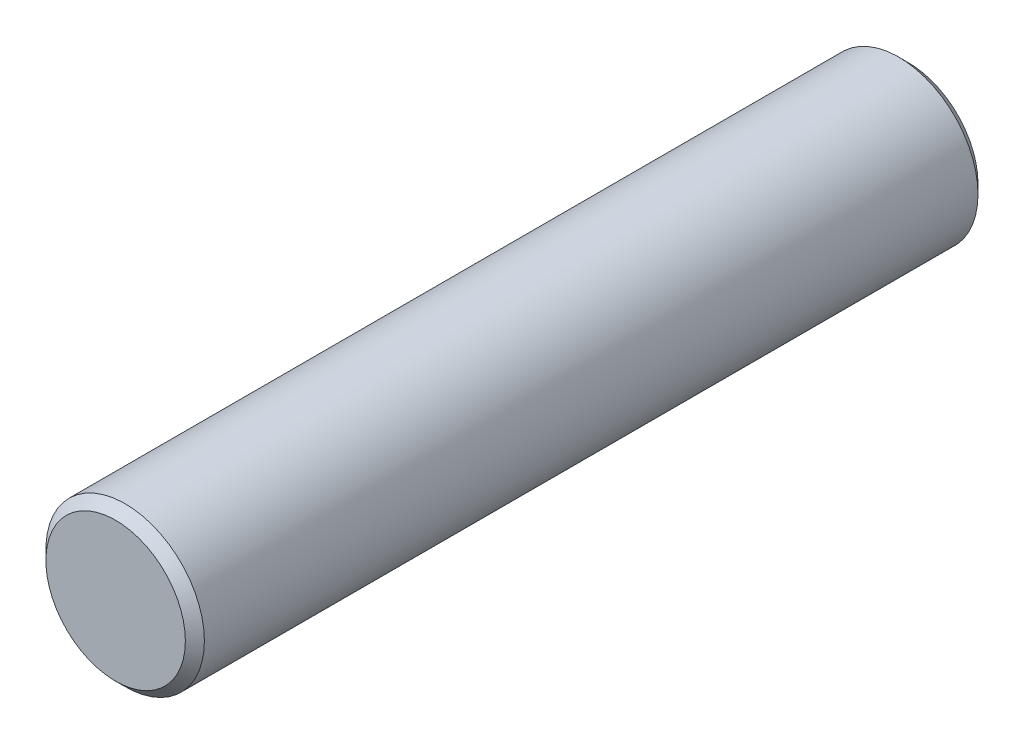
ISO-10303-21;
HEADER;
FILE_DESCRIPTION(('STEP AP214'),'2;1');
FILE_NAME('part.step','',(''),(''),'','','');
FILE_SCHEMA(('AUTOMOTIVE_DESIGN { 1 0 10303 214 1 1 1 1 }'));
ENDSEC;
DATA;
#1=APPLICATION_CONTEXT('core data for automotive mechanical design processes');
#2=APPLICATION_PROTOCOL_DEFINITION('international standard','automotive_design',2000,#1);
#3=PRODUCT_CONTEXT('',#1,'mechanical');
#4=PRODUCT('Part','Part','',(#3));
#5=PRODUCT_RELATED_PRODUCT_CATEGORY('part','',(#4));
#6=PRODUCT_DEFINITION_FORMATION('','',#4);
#7=PRODUCT_DEFINITION_CONTEXT('part definition',#1,'design');
#8=PRODUCT_DEFINITION('design','',#6,#7);
#9=PRODUCT_DEFINITION_SHAPE('','',#8);
#10=(LENGTH_UNIT() NAMED_UNIT(*) SI_UNIT(.MILLI.,.METRE.));
#11=(NAMED_UNIT(*) PLANE_ANGLE_UNIT() SI_UNIT($,.RADIAN.));
#12=(NAMED_UNIT(*) SI_UNIT($,.STERADIAN.) SOLID_ANGLE_UNIT());
#13=UNCERTAINTY_MEASURE_WITH_UNIT(LENGTH_MEASURE(1.E-05),#10,'distance_accuracy_value','');
#14=(GEOMETRIC_REPRESENTATION_CONTEXT(3) GLOBAL_UNCERTAINTY_ASSIGNED_CONTEXT((#13)) GLOBAL_UNIT_ASSIGNED_CONTEXT((#10,
#11,#12)) REPRESENTATION_CONTEXT('',''));
#15=CARTESIAN_POINT('',(0.,0.,0.));
#16=DIRECTION('',(0.,0.,1.));
#17=DIRECTION('',(1.,0.,0.));
#18=AXIS2_PLACEMENT_3D('',#15,#16,#17);
#19=CARTESIAN_POINT('',(-31.0331198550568,51.6836947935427,-32.0710678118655));
#20=DIRECTION('',(0.,0.,1.));
#21=DIRECTION('',(1.,0.,0.));
#22=AXIS2_PLACEMENT_3D('',#19,#20,#21);
#23=CYLINDRICAL_SURFACE('',#22,2.5);
#24=CARTESIAN_POINT('',(-31.0331198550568,51.6836947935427,-24.7));
#25=DIRECTION('',(0.,0.,1.));
#26=DIRECTION('',(1.,0.,0.));
#27=AXIS2_PLACEMENT_3D('',#24,#25,#26);
#28=CIRCLE('',#27,2.5);
#29=CARTESIAN_POINT('',(-28.5331198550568,51.6836947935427,-24.7));
#30=VERTEX_POINT('',#29);
#31=EDGE_CURVE('E359',#30,#30,#28,.T.);
#32=ORIENTED_EDGE('',*,*,#31,.T.);
#33=EDGE_LOOP('',(#32));
#34=FACE_BOUND('',#33,.T.);
#35=CARTESIAN_POINT('',(-31.0331198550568,51.6836947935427,-0.299999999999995));
#36=DIRECTION('',(0.,0.,1.));
#37=DIRECTION('',(1.,0.,0.));
#38=AXIS2_PLACEMENT_3D('',#35,#36,#37);
#39=CIRCLE('',#38,2.5);
#40=CARTESIAN_POINT('',(-28.5331198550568,51.6836947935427,-0.299999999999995));
#41=VERTEX_POINT('',#40);
#42=EDGE_CURVE('E363',#41,#41,#39,.F.);
#43=ORIENTED_EDGE('',*,*,#42,.T.);
#44=EDGE_LOOP('',(#43));
#45=FACE_BOUND('',#44,.T.);
#46=ADVANCED_FACE('F353',(#34,#45),#23,.T.);
#47=CARTESIAN_POINT('',(-31.0331198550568,51.6836947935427,0.));
#48=DIRECTION('',(0.,0.,1.));
#49=DIRECTION('',(1.,0.,0.));
#50=AXIS2_PLACEMENT_3D('',#47,#48,#49);
#51=PLANE('',#50);
#52=CARTESIAN_POINT('',(-31.0331198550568,51.6836947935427,0.));
#53=DIRECTION('',(0.,0.,1.));
#54=DIRECTION('',(1.,0.,0.));
#55=AXIS2_PLACEMENT_3D('',#52,#53,#54);
#56=CIRCLE('',#55,2.2);
#57=CARTESIAN_POINT('',(-28.8331198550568,51.6836947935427,0.));
#58=VERTEX_POINT('',#57);
#59=EDGE_CURVE('E10',#58,#58,#56,.T.);
#60=ORIENTED_EDGE('',*,*,#59,.T.);
#61=EDGE_LOOP('',(#60));
#62=FACE_BOUND('',#61,.T.);
#63=ADVANCED_FACE('F386',(#62),#51,.T.);
#64=CARTESIAN_POINT('',(-40.,57.13081232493,-25.));
#65=DIRECTION('',(0.,0.,1.));
#66=DIRECTION('',(0.,1.,0.));
#67=AXIS2_PLACEMENT_3D('',#64,#65,#66);
#68=PLANE('',#67);
#69=CARTESIAN_POINT('',(-31.0331198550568,51.6836947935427,-25.));
#70=DIRECTION('',(0.,0.,1.));
#71=DIRECTION('',(0.,-1.,0.));
#72=AXIS2_PLACEMENT_3D('',#69,#70,#71);
#73=CIRCLE('',#72,2.2);
#74=CARTESIAN_POINT('',(-31.0331198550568,49.4836947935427,-25.));
#75=VERTEX_POINT('',#74);
#76=EDGE_CURVE('E367',#75,#75,#73,.F.);
#77=ORIENTED_EDGE('',*,*,#76,.T.);
#78=EDGE_LOOP('',(#77));
#79=FACE_BOUND('',#78,.T.);
#80=ADVANCED_FACE('F373',(#79),#68,.F.);
#81=CARTESIAN_POINT('',(-31.0331198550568,51.6836947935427,-25.));
#82=DIRECTION('',(0.,0.,1.));
#83=DIRECTION('',(1.,0.,0.));
#84=AXIS2_PLACEMENT_3D('',#81,#82,#83);
#85=CONICAL_SURFACE('',#84,2.2,0.785398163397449);
#86=ORIENTED_EDGE('',*,*,#31,.F.);
#87=EDGE_LOOP('',(#86));
#88=FACE_BOUND('',#87,.T.);
#89=ORIENTED_EDGE('',*,*,#76,.F.);
#90=EDGE_LOOP('',(#89));
#91=FACE_BOUND('',#90,.T.);
#92=ADVANCED_FACE('F375',(#88,#91),#85,.T.);
#93=CARTESIAN_POINT('',(-31.0331198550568,51.6836947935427,0.));
#94=DIRECTION('',(0.,0.,-1.));
#95=DIRECTION('',(-1.,0.,0.));
#96=AXIS2_PLACEMENT_3D('',#93,#94,#95);
#97=CONICAL_SURFACE('',#96,2.2,0.785398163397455);
#98=ORIENTED_EDGE('',*,*,#42,.F.);
#99=EDGE_LOOP('',(#98));
#100=FACE_BOUND('',#99,.T.);
#101=ORIENTED_EDGE('',*,*,#59,.F.);
#102=EDGE_LOOP('',(#101));
#103=FACE_BOUND('',#102,.T.);
#104=ADVANCED_FACE('F377',(#100,#103),#97,.T.);
#105=CLOSED_SHELL('',(#46,#63,#80,#92,#104));
#106=MANIFOLD_SOLID_BREP('B2',#105);
#107=ADVANCED_BREP_SHAPE_REPRESENTATION('',(#18,#106),#14);
#108=SHAPE_DEFINITION_REPRESENTATION(#9,#107);
ENDSEC;
END-ISO-10303-21;
